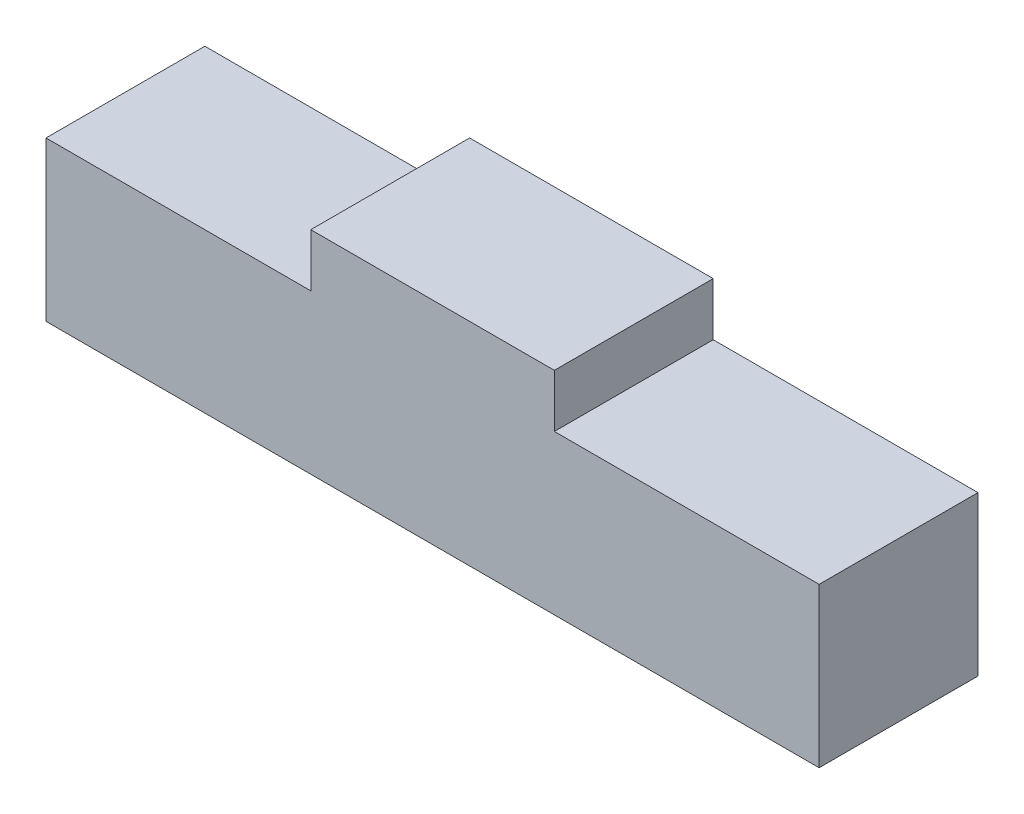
ISO-10303-21;
HEADER;
FILE_DESCRIPTION(('STEP AP214'),'2;1');
FILE_NAME('part.step','',(''),(''),'','','');
FILE_SCHEMA(('AUTOMOTIVE_DESIGN { 1 0 10303 214 1 1 1 1 }'));
ENDSEC;
DATA;
#1=APPLICATION_CONTEXT('core data for automotive mechanical design processes');
#2=APPLICATION_PROTOCOL_DEFINITION('international standard','automotive_design',2000,#1);
#3=PRODUCT_CONTEXT('',#1,'mechanical');
#4=PRODUCT('Part','Part','',(#3));
#5=PRODUCT_RELATED_PRODUCT_CATEGORY('part','',(#4));
#6=PRODUCT_DEFINITION_FORMATION('','',#4);
#7=PRODUCT_DEFINITION_CONTEXT('part definition',#1,'design');
#8=PRODUCT_DEFINITION('design','',#6,#7);
#9=PRODUCT_DEFINITION_SHAPE('','',#8);
#10=(LENGTH_UNIT() NAMED_UNIT(*) SI_UNIT(.MILLI.,.METRE.));
#11=(NAMED_UNIT(*) PLANE_ANGLE_UNIT() SI_UNIT($,.RADIAN.));
#12=(NAMED_UNIT(*) SI_UNIT($,.STERADIAN.) SOLID_ANGLE_UNIT());
#13=UNCERTAINTY_MEASURE_WITH_UNIT(LENGTH_MEASURE(1.E-05),#10,'distance_accuracy_value','');
#14=(GEOMETRIC_REPRESENTATION_CONTEXT(3) GLOBAL_UNCERTAINTY_ASSIGNED_CONTEXT((#13)) GLOBAL_UNIT_ASSIGNED_CONTEXT((#10,
#11,#12)) REPRESENTATION_CONTEXT('',''));
#15=CARTESIAN_POINT('',(0.,0.,0.));
#16=DIRECTION('',(0.,0.,1.));
#17=DIRECTION('',(1.,0.,0.));
#18=AXIS2_PLACEMENT_3D('',#15,#16,#17);
#19=CARTESIAN_POINT('',(-2.3,4.,3.));
#20=DIRECTION('',(0.,-1.,0.));
#21=DIRECTION('',(0.,0.,-1.));
#22=AXIS2_PLACEMENT_3D('',#19,#20,#21);
#23=PLANE('',#22);
#24=DIRECTION('',(-1.,0.,0.));
#25=VECTOR('',#24,1.);
#26=CARTESIAN_POINT('',(-2.3,4.,0.));
#27=LINE('',#26,#25);
#28=CARTESIAN_POINT('',(2.3,4.,0.));
#29=VERTEX_POINT('',#28);
#30=CARTESIAN_POINT('',(-2.3,4.,0.));
#31=VERTEX_POINT('',#30);
#32=EDGE_CURVE('E98',#29,#31,#27,.T.);
#33=ORIENTED_EDGE('',*,*,#32,.T.);
#34=DIRECTION('',(0.,0.,-1.));
#35=VECTOR('',#34,1.);
#36=CARTESIAN_POINT('',(-2.3,4.,3.));
#37=LINE('',#36,#35);
#38=CARTESIAN_POINT('',(-2.3,4.,3.));
#39=VERTEX_POINT('',#38);
#40=EDGE_CURVE('E11',#39,#31,#37,.T.);
#41=ORIENTED_EDGE('',*,*,#40,.F.);
#42=DIRECTION('',(-1.,0.,0.));
#43=VECTOR('',#42,1.);
#44=CARTESIAN_POINT('',(-2.3,4.,3.));
#45=LINE('',#44,#43);
#46=CARTESIAN_POINT('',(2.3,4.,3.));
#47=VERTEX_POINT('',#46);
#48=EDGE_CURVE('E119',#47,#39,#45,.T.);
#49=ORIENTED_EDGE('',*,*,#48,.F.);
#50=DIRECTION('',(0.,0.,-1.));
#51=VECTOR('',#50,1.);
#52=CARTESIAN_POINT('',(2.3,4.,3.));
#53=LINE('',#52,#51);
#54=EDGE_CURVE('E108',#47,#29,#53,.T.);
#55=ORIENTED_EDGE('',*,*,#54,.T.);
#56=EDGE_LOOP('',(#33,#41,#49,#55));
#57=FACE_BOUND('',#56,.T.);
#58=ADVANCED_FACE('F35',(#57),#23,.F.);
#59=CARTESIAN_POINT('',(-2.3,3.,3.));
#60=DIRECTION('',(1.,0.,0.));
#61=DIRECTION('',(0.,0.,-1.));
#62=AXIS2_PLACEMENT_3D('',#59,#60,#61);
#63=PLANE('',#62);
#64=DIRECTION('',(0.,-1.,0.));
#65=VECTOR('',#64,1.);
#66=CARTESIAN_POINT('',(-2.3,3.,0.));
#67=LINE('',#66,#65);
#68=CARTESIAN_POINT('',(-2.3,3.,0.));
#69=VERTEX_POINT('',#68);
#70=EDGE_CURVE('E104',#31,#69,#67,.T.);
#71=ORIENTED_EDGE('',*,*,#70,.T.);
#72=DIRECTION('',(0.,0.,-1.));
#73=VECTOR('',#72,1.);
#74=CARTESIAN_POINT('',(-2.3,3.,3.));
#75=LINE('',#74,#73);
#76=CARTESIAN_POINT('',(-2.3,3.,3.));
#77=VERTEX_POINT('',#76);
#78=EDGE_CURVE('E42',#77,#69,#75,.T.);
#79=ORIENTED_EDGE('',*,*,#78,.F.);
#80=DIRECTION('',(0.,-1.,0.));
#81=VECTOR('',#80,1.);
#82=CARTESIAN_POINT('',(-2.3,3.,3.));
#83=LINE('',#82,#81);
#84=EDGE_CURVE('E134',#39,#77,#83,.T.);
#85=ORIENTED_EDGE('',*,*,#84,.F.);
#86=ORIENTED_EDGE('',*,*,#40,.T.);
#87=EDGE_LOOP('',(#71,#79,#85,#86));
#88=FACE_BOUND('',#87,.T.);
#89=ADVANCED_FACE('F181',(#88),#63,.F.);
#90=CARTESIAN_POINT('',(-7.3,3.,3.));
#91=DIRECTION('',(0.,-1.,0.));
#92=DIRECTION('',(0.,0.,-1.));
#93=AXIS2_PLACEMENT_3D('',#90,#91,#92);
#94=PLANE('',#93);
#95=DIRECTION('',(-1.,0.,0.));
#96=VECTOR('',#95,1.);
#97=CARTESIAN_POINT('',(-7.3,3.,0.));
#98=LINE('',#97,#96);
#99=CARTESIAN_POINT('',(-7.3,3.,0.));
#100=VERTEX_POINT('',#99);
#101=EDGE_CURVE('E127',#69,#100,#98,.T.);
#102=ORIENTED_EDGE('',*,*,#101,.T.);
#103=DIRECTION('',(0.,0.,-1.));
#104=VECTOR('',#103,1.);
#105=CARTESIAN_POINT('',(-7.3,3.,3.));
#106=LINE('',#105,#104);
#107=CARTESIAN_POINT('',(-7.3,3.,3.));
#108=VERTEX_POINT('',#107);
#109=EDGE_CURVE('E143',#108,#100,#106,.T.);
#110=ORIENTED_EDGE('',*,*,#109,.F.);
#111=DIRECTION('',(-1.,0.,0.));
#112=VECTOR('',#111,1.);
#113=CARTESIAN_POINT('',(-7.3,3.,3.));
#114=LINE('',#113,#112);
#115=EDGE_CURVE('E54',#77,#108,#114,.T.);
#116=ORIENTED_EDGE('',*,*,#115,.F.);
#117=ORIENTED_EDGE('',*,*,#78,.T.);
#118=EDGE_LOOP('',(#102,#110,#116,#117));
#119=FACE_BOUND('',#118,.T.);
#120=ADVANCED_FACE('F148',(#119),#94,.F.);
#121=CARTESIAN_POINT('',(-7.3,0.,3.));
#122=DIRECTION('',(1.,0.,0.));
#123=DIRECTION('',(0.,0.,-1.));
#124=AXIS2_PLACEMENT_3D('',#121,#122,#123);
#125=PLANE('',#124);
#126=DIRECTION('',(0.,-1.,0.));
#127=VECTOR('',#126,1.);
#128=CARTESIAN_POINT('',(-7.3,0.,0.));
#129=LINE('',#128,#127);
#130=CARTESIAN_POINT('',(-7.3,0.,0.));
#131=VERTEX_POINT('',#130);
#132=EDGE_CURVE('E129',#100,#131,#129,.T.);
#133=ORIENTED_EDGE('',*,*,#132,.T.);
#134=DIRECTION('',(0.,0.,-1.));
#135=VECTOR('',#134,1.);
#136=CARTESIAN_POINT('',(-7.3,0.,3.));
#137=LINE('',#136,#135);
#138=CARTESIAN_POINT('',(-7.3,0.,3.));
#139=VERTEX_POINT('',#138);
#140=EDGE_CURVE('E140',#139,#131,#137,.T.);
#141=ORIENTED_EDGE('',*,*,#140,.F.);
#142=DIRECTION('',(0.,-1.,0.));
#143=VECTOR('',#142,1.);
#144=CARTESIAN_POINT('',(-7.3,0.,3.));
#145=LINE('',#144,#143);
#146=EDGE_CURVE('E49',#108,#139,#145,.T.);
#147=ORIENTED_EDGE('',*,*,#146,.F.);
#148=ORIENTED_EDGE('',*,*,#109,.T.);
#149=EDGE_LOOP('',(#133,#141,#147,#148));
#150=FACE_BOUND('',#149,.T.);
#151=ADVANCED_FACE('F155',(#150),#125,.F.);
#152=CARTESIAN_POINT('',(0.,0.,3.));
#153=DIRECTION('',(0.,1.,0.));
#154=DIRECTION('',(0.,0.,1.));
#155=AXIS2_PLACEMENT_3D('',#152,#153,#154);
#156=PLANE('',#155);
#157=DIRECTION('',(1.,0.,0.));
#158=VECTOR('',#157,1.);
#159=CARTESIAN_POINT('',(0.,0.,0.));
#160=LINE('',#159,#158);
#161=CARTESIAN_POINT('',(7.3,0.,0.));
#162=VERTEX_POINT('',#161);
#163=EDGE_CURVE('E131',#131,#162,#160,.T.);
#164=ORIENTED_EDGE('',*,*,#163,.T.);
#165=DIRECTION('',(0.,0.,-1.));
#166=VECTOR('',#165,1.);
#167=CARTESIAN_POINT('',(7.3,0.,3.));
#168=LINE('',#167,#166);
#169=CARTESIAN_POINT('',(7.3,0.,3.));
#170=VERTEX_POINT('',#169);
#171=EDGE_CURVE('E161',#170,#162,#168,.T.);
#172=ORIENTED_EDGE('',*,*,#171,.F.);
#173=DIRECTION('',(1.,0.,0.));
#174=VECTOR('',#173,1.);
#175=CARTESIAN_POINT('',(0.,0.,3.));
#176=LINE('',#175,#174);
#177=EDGE_CURVE('E138',#139,#170,#176,.T.);
#178=ORIENTED_EDGE('',*,*,#177,.F.);
#179=ORIENTED_EDGE('',*,*,#140,.T.);
#180=EDGE_LOOP('',(#164,#172,#178,#179));
#181=FACE_BOUND('',#180,.T.);
#182=ADVANCED_FACE('F158',(#181),#156,.F.);
#183=CARTESIAN_POINT('',(0.,0.,3.));
#184=DIRECTION('',(0.,0.,-1.));
#185=DIRECTION('',(-1.,0.,0.));
#186=AXIS2_PLACEMENT_3D('',#183,#184,#185);
#187=PLANE('',#186);
#188=ORIENTED_EDGE('',*,*,#177,.T.);
#189=DIRECTION('',(0.,-1.,0.));
#190=VECTOR('',#189,1.);
#191=CARTESIAN_POINT('',(7.3,0.,3.));
#192=LINE('',#191,#190);
#193=CARTESIAN_POINT('',(7.3,3.,3.));
#194=VERTEX_POINT('',#193);
#195=EDGE_CURVE('E164',#194,#170,#192,.T.);
#196=ORIENTED_EDGE('',*,*,#195,.F.);
#197=DIRECTION('',(1.,0.,0.));
#198=VECTOR('',#197,1.);
#199=CARTESIAN_POINT('',(7.3,3.,3.));
#200=LINE('',#199,#198);
#201=CARTESIAN_POINT('',(2.3,3.,3.));
#202=VERTEX_POINT('',#201);
#203=EDGE_CURVE('E167',#202,#194,#200,.T.);
#204=ORIENTED_EDGE('',*,*,#203,.F.);
#205=DIRECTION('',(0.,-1.,0.));
#206=VECTOR('',#205,1.);
#207=CARTESIAN_POINT('',(2.3,3.,3.));
#208=LINE('',#207,#206);
#209=EDGE_CURVE('E175',#47,#202,#208,.T.);
#210=ORIENTED_EDGE('',*,*,#209,.F.);
#211=ORIENTED_EDGE('',*,*,#48,.T.);
#212=ORIENTED_EDGE('',*,*,#84,.T.);
#213=ORIENTED_EDGE('',*,*,#115,.T.);
#214=ORIENTED_EDGE('',*,*,#146,.T.);
#215=EDGE_LOOP('',(#188,#196,#204,#210,#211,#212,#213,#214));
#216=FACE_BOUND('',#215,.T.);
#217=ADVANCED_FACE('F163',(#216),#187,.F.);
#218=CARTESIAN_POINT('',(0.,0.,0.));
#219=DIRECTION('',(0.,0.,-1.));
#220=DIRECTION('',(-1.,0.,0.));
#221=AXIS2_PLACEMENT_3D('',#218,#219,#220);
#222=PLANE('',#221);
#223=ORIENTED_EDGE('',*,*,#32,.F.);
#224=DIRECTION('',(0.,-1.,0.));
#225=VECTOR('',#224,1.);
#226=CARTESIAN_POINT('',(2.3,3.,0.));
#227=LINE('',#226,#225);
#228=CARTESIAN_POINT('',(2.3,3.,0.));
#229=VERTEX_POINT('',#228);
#230=EDGE_CURVE('E102',#29,#229,#227,.T.);
#231=ORIENTED_EDGE('',*,*,#230,.T.);
#232=DIRECTION('',(1.,0.,0.));
#233=VECTOR('',#232,1.);
#234=CARTESIAN_POINT('',(7.3,3.,0.));
#235=LINE('',#234,#233);
#236=CARTESIAN_POINT('',(7.3,3.,0.));
#237=VERTEX_POINT('',#236);
#238=EDGE_CURVE('E117',#229,#237,#235,.T.);
#239=ORIENTED_EDGE('',*,*,#238,.T.);
#240=DIRECTION('',(0.,-1.,0.));
#241=VECTOR('',#240,1.);
#242=CARTESIAN_POINT('',(7.3,0.,0.));
#243=LINE('',#242,#241);
#244=EDGE_CURVE('E172',#237,#162,#243,.T.);
#245=ORIENTED_EDGE('',*,*,#244,.T.);
#246=ORIENTED_EDGE('',*,*,#163,.F.);
#247=ORIENTED_EDGE('',*,*,#132,.F.);
#248=ORIENTED_EDGE('',*,*,#101,.F.);
#249=ORIENTED_EDGE('',*,*,#70,.F.);
#250=EDGE_LOOP('',(#223,#231,#239,#245,#246,#247,#248,#249));
#251=FACE_BOUND('',#250,.T.);
#252=ADVANCED_FACE('F100',(#251),#222,.T.);
#253=CARTESIAN_POINT('',(2.3,3.,3.));
#254=DIRECTION('',(-1.,0.,0.));
#255=DIRECTION('',(0.,0.,-1.));
#256=AXIS2_PLACEMENT_3D('',#253,#254,#255);
#257=PLANE('',#256);
#258=ORIENTED_EDGE('',*,*,#230,.F.);
#259=ORIENTED_EDGE('',*,*,#54,.F.);
#260=ORIENTED_EDGE('',*,*,#209,.T.);
#261=DIRECTION('',(0.,0.,-1.));
#262=VECTOR('',#261,1.);
#263=CARTESIAN_POINT('',(2.3,3.,3.));
#264=LINE('',#263,#262);
#265=EDGE_CURVE('E116',#202,#229,#264,.T.);
#266=ORIENTED_EDGE('',*,*,#265,.T.);
#267=EDGE_LOOP('',(#258,#259,#260,#266));
#268=FACE_BOUND('',#267,.T.);
#269=ADVANCED_FACE('F113',(#268),#257,.F.);
#270=CARTESIAN_POINT('',(7.3,3.,3.));
#271=DIRECTION('',(0.,-1.,0.));
#272=DIRECTION('',(0.,0.,-1.));
#273=AXIS2_PLACEMENT_3D('',#270,#271,#272);
#274=PLANE('',#273);
#275=ORIENTED_EDGE('',*,*,#238,.F.);
#276=ORIENTED_EDGE('',*,*,#265,.F.);
#277=ORIENTED_EDGE('',*,*,#203,.T.);
#278=DIRECTION('',(0.,0.,-1.));
#279=VECTOR('',#278,1.);
#280=CARTESIAN_POINT('',(7.3,3.,3.));
#281=LINE('',#280,#279);
#282=EDGE_CURVE('E122',#194,#237,#281,.T.);
#283=ORIENTED_EDGE('',*,*,#282,.T.);
#284=EDGE_LOOP('',(#275,#276,#277,#283));
#285=FACE_BOUND('',#284,.T.);
#286=ADVANCED_FACE('F174',(#285),#274,.F.);
#287=CARTESIAN_POINT('',(7.3,0.,3.));
#288=DIRECTION('',(-1.,0.,0.));
#289=DIRECTION('',(0.,0.,-1.));
#290=AXIS2_PLACEMENT_3D('',#287,#288,#289);
#291=PLANE('',#290);
#292=ORIENTED_EDGE('',*,*,#244,.F.);
#293=ORIENTED_EDGE('',*,*,#282,.F.);
#294=ORIENTED_EDGE('',*,*,#195,.T.);
#295=ORIENTED_EDGE('',*,*,#171,.T.);
#296=EDGE_LOOP('',(#292,#293,#294,#295));
#297=FACE_BOUND('',#296,.T.);
#298=ADVANCED_FACE('F171',(#297),#291,.F.);
#299=CLOSED_SHELL('',(#58,#89,#120,#151,#182,#217,#252,#269,#286,#298));
#300=MANIFOLD_SOLID_BREP('B2',#299);
#301=ADVANCED_BREP_SHAPE_REPRESENTATION('',(#18,#300),#14);
#302=SHAPE_DEFINITION_REPRESENTATION(#9,#301);
ENDSEC;
END-ISO-10303-21;
